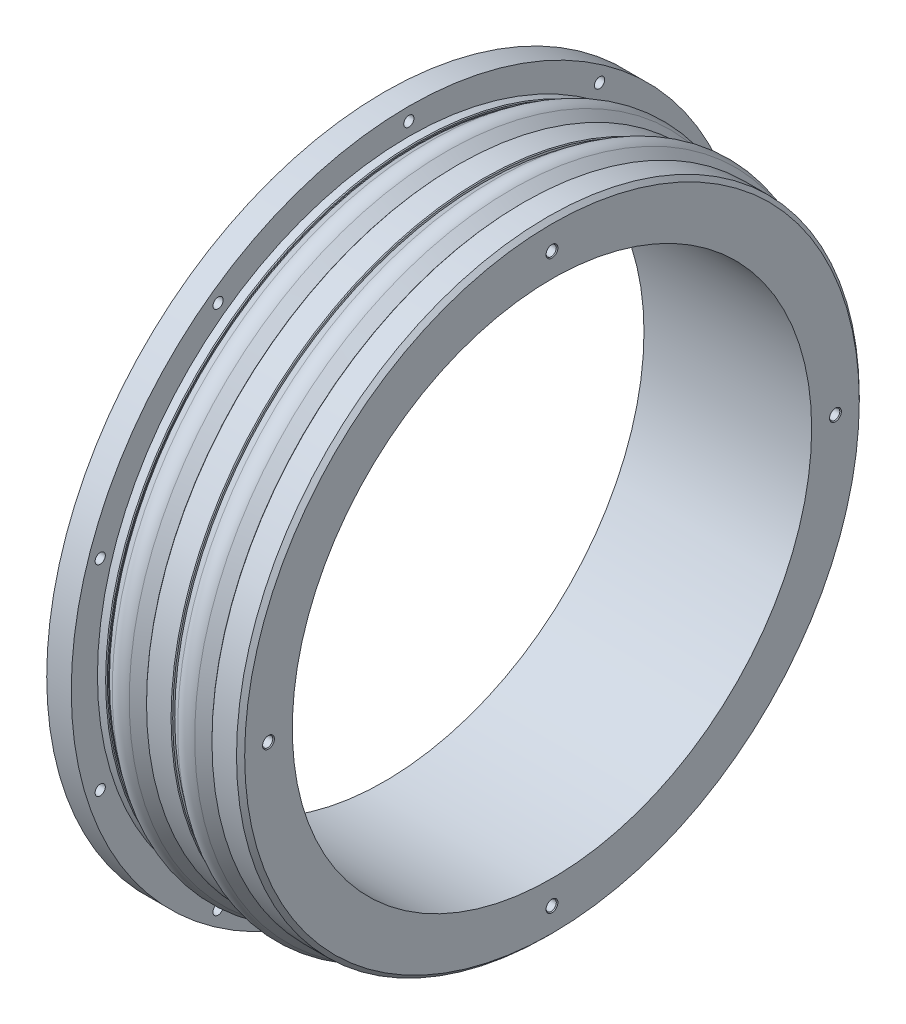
from build123d import *
from OCP.BRepFilletAPI import BRepFilletAPI_MakeChamfer

# Parameters (mm, degrees)
CHAMFER1_SIZE                         = 1
CHAMFER2_SIZE                         = 0.2
CHAMFER2_SIZE2                        = 0.142980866
SKETCH4_W                             = 1.25
SKETCH4_H                             = 6.498
TAP_DRILL_FOR_M3X0_5_TAP1_AT_2_COUNT  = 2
TAP_DRILL_FOR_M3X0_5_TAP1_AT_2_PITCH  = 49.040997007
TAP_DRILL_FOR_M3X0_5_TAP1_AT_3_COUNT  = 2
TAP_DRILL_FOR_M3X0_5_TAP1_AT_3_PITCH  = 93.281519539
TAP_DRILL_FOR_M3X0_5_TAP1_AT_4_COUNT  = 2
TAP_DRILL_FOR_M3X0_5_TAP1_AT_4_PITCH  = 128.390997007
TAP_DRILL_FOR_M3X0_5_TAP1_AT_5_COUNT  = 2
TAP_DRILL_FOR_M3X0_5_TAP1_AT_5_PITCH  = 150.932669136
TAP_DRILL_FOR_M3X0_5_TAP1_AT_6_COUNT  = 2
TAP_DRILL_FOR_M3X0_5_TAP1_AT_6_PITCH  = 158.7
TAP_DRILL_FOR_M3X0_5_TAP1_AT_7_COUNT  = 2
TAP_DRILL_FOR_M3X0_5_TAP1_AT_7_PITCH  = 150.932669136
TAP_DRILL_FOR_M3X0_5_TAP1_AT_8_COUNT  = 2
TAP_DRILL_FOR_M3X0_5_TAP1_AT_8_PITCH  = 128.390997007
TAP_DRILL_FOR_M3X0_5_TAP1_AT_9_COUNT  = 2
TAP_DRILL_FOR_M3X0_5_TAP1_AT_9_PITCH  = 93.281519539
TAP_DRILL_FOR_M3X0_5_TAP1_AT_10_COUNT = 2
TAP_DRILL_FOR_M3X0_5_TAP1_AT_10_PITCH = 49.040997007
CHAMFER3_SIZE                         = 0.2
TAP_DRILL_FOR_M3X0_5_TAP2_D           = 2.5
TAP_DRILL_FOR_M3X0_5_TAP2_DEPTH       = 4
TAP_DRILL_FOR_M3X0_5_TAP2_TIP         = 0.751075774
CHAMFER4_SIZE                         = 0.2


with BuildPart() as part:
    # Sketch2 → Revolve1 (revolve)
    with BuildSketch(Plane(origin=(0, 0, 0), x_dir=(1, 0, 0), z_dir=(0, 1, 0))):
        with BuildLine():
            Line((0, 63.5), (41, 63.5))
            Line((41, 63.5), (41, 76.145))
            Line((41, 76.145), (33.8, 76.145))
            Line((33.8, 76.145), (33.8, 75.445))
            Line((33.8, 75.445), (31.083348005, 77.45741197))
            ThreePointArc((31.083348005, 77.45741197), (29, 78.145), (26.916651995, 77.45741197))
            Line((26.916651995, 77.45741197), (24.2, 75.445))
            Line((24.2, 75.445), (24.2, 76.145))
            Line((24.2, 76.145), (17.8, 76.145))
            Line((17.8, 76.145), (17.8, 75.445))
            Line((17.8, 75.445), (15.083348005, 77.45741197))
            ThreePointArc((15.083348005, 77.45741197), (13, 78.145), (10.916651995, 77.45741197))
            Line((10.916651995, 77.45741197), (8.2, 75.445))
            Line((8.2, 75.445), (8.2, 76.145))
            Line((8.2, 76.145), (6, 76.145))
            Line((6, 76.145), (6, 82.55))
            Line((6, 82.55), (0, 82.55))
            Line((0, 82.55), (0, 75.871))
            Line((0, 75.871), (0.75, 75.871))
            Line((0.75, 75.871), (0.009866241, 75.32584129))
            ThreePointArc((0.009866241, 75.32584129), (-0.498, 74.321), (0.009866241, 73.31615871))
            Line((0.009866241, 73.31615871), (0.75, 72.771))
            Line((0.75, 72.771), (0, 72.771))
            Line((0, 72.771), (0, 63.5))
        make_face()
    revolve(axis=Axis((0, 0, 0), (-1, 0, 0)))

    # Chamfer1
    chamfer1_edges = [part.edges().sort_by_distance(p)[0] for p in [
        (41, 0, 76.145),
    ]]
    chamfer(chamfer1_edges, length=CHAMFER1_SIZE)

    # Chamfer2: one chamfer whose edges measure the first distance from different faces: ONE call of the kernel's chamfer builder (chamfer() names one face for all edges)
    chamfer2_edges_1 = [part.edges().sort_by_distance(p)[0] for p in [
        (0, 0, 75.871),
        (8.2, 0, 76.145),
        (17.8, 0, 76.145),
        (24.2, 0, 76.145),
        (33.8, 0, 76.145),
        (0, 0, 72.771),
    ]]
    chamfer2_edges_2 = [part.edges().sort_by_distance(p)[0] for p in [
        (8.2, 0, 75.445),
    ]]
    chamfer2_side_2 = [part.faces().sort_by_distance(p)[0] for p in [
        (8.2, 0, 75.660370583),
    ]]
    chamfer2 = BRepFilletAPI_MakeChamfer(part.part.solid().wrapped)
    for e in chamfer2_edges_1:
        chamfer2.Add(CHAMFER2_SIZE, e.wrapped)
    for e in chamfer2_edges_2:
        chamfer2.Add(CHAMFER2_SIZE, CHAMFER2_SIZE2, e.wrapped, chamfer2_side_2[0].wrapped)  # the first distance lies on this face
    add(Compound.cast(chamfer2.Shape()), mode=Mode.REPLACE)

    # Sketch4 → Tap Drill for M3x0.5 Tap1 (revolve, cut)
    with BuildSketch(Plane(origin=(6, 79.35, 0), x_dir=(0, 0, -1), z_dir=(0, 1, 0))):
        with Locations((0.625, 3.249)):
            Rectangle(SKETCH4_W, SKETCH4_H)
    tap_drill_for_m3x0_5_tap1 = revolve(axis=Axis((12.35, 79.35, 0), (-1, 0, 0)), mode=Mode.SUBTRACT)

    # Tap Drill for M3x0.5 Tap1 at 2: Tap Drill for M3x0.5 Tap1 ×2
    with Locations(*[Vector(0, -0.30901699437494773, -0.9510565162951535) * (i * TAP_DRILL_FOR_M3X0_5_TAP1_AT_2_PITCH) for i in range(1, TAP_DRILL_FOR_M3X0_5_TAP1_AT_2_COUNT)]):
        add(tap_drill_for_m3x0_5_tap1, mode=Mode.SUBTRACT)

    # Tap Drill for M3x0.5 Tap1 at 3: Tap Drill for M3x0.5 Tap1 ×2
    with Locations(*[Vector(0, -0.5877852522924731, -0.8090169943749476) * (i * TAP_DRILL_FOR_M3X0_5_TAP1_AT_3_PITCH) for i in range(1, TAP_DRILL_FOR_M3X0_5_TAP1_AT_3_COUNT)]):
        add(tap_drill_for_m3x0_5_tap1, mode=Mode.SUBTRACT)

    # Tap Drill for M3x0.5 Tap1 at 4: Tap Drill for M3x0.5 Tap1 ×2
    with Locations(*[Vector(0, -0.8090169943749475, -0.5877852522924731) * (i * TAP_DRILL_FOR_M3X0_5_TAP1_AT_4_PITCH) for i in range(1, TAP_DRILL_FOR_M3X0_5_TAP1_AT_4_COUNT)]):
        add(tap_drill_for_m3x0_5_tap1, mode=Mode.SUBTRACT)

    # Tap Drill for M3x0.5 Tap1 at 5: Tap Drill for M3x0.5 Tap1 ×2
    with Locations(*[Vector(0, -0.9510565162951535, -0.3090169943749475) * (i * TAP_DRILL_FOR_M3X0_5_TAP1_AT_5_PITCH) for i in range(1, TAP_DRILL_FOR_M3X0_5_TAP1_AT_5_COUNT)]):
        add(tap_drill_for_m3x0_5_tap1, mode=Mode.SUBTRACT)

    # Tap Drill for M3x0.5 Tap1 at 6: Tap Drill for M3x0.5 Tap1 ×2
    with Locations(*[(0, -i * TAP_DRILL_FOR_M3X0_5_TAP1_AT_6_PITCH, 0) for i in range(1, TAP_DRILL_FOR_M3X0_5_TAP1_AT_6_COUNT)]):
        add(tap_drill_for_m3x0_5_tap1, mode=Mode.SUBTRACT)

    # Tap Drill for M3x0.5 Tap1 at 7: Tap Drill for M3x0.5 Tap1 ×2
    with Locations(*[Vector(0, -0.9510565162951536, 0.30901699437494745) * (i * TAP_DRILL_FOR_M3X0_5_TAP1_AT_7_PITCH) for i in range(1, TAP_DRILL_FOR_M3X0_5_TAP1_AT_7_COUNT)]):
        add(tap_drill_for_m3x0_5_tap1, mode=Mode.SUBTRACT)

    # Tap Drill for M3x0.5 Tap1 at 8: Tap Drill for M3x0.5 Tap1 ×2
    with Locations(*[Vector(0, -0.8090169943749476, 0.5877852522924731) * (i * TAP_DRILL_FOR_M3X0_5_TAP1_AT_8_PITCH) for i in range(1, TAP_DRILL_FOR_M3X0_5_TAP1_AT_8_COUNT)]):
        add(tap_drill_for_m3x0_5_tap1, mode=Mode.SUBTRACT)

    # Tap Drill for M3x0.5 Tap1 at 9: Tap Drill for M3x0.5 Tap1 ×2
    with Locations(*[Vector(0, -0.5877852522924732, 0.8090169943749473) * (i * TAP_DRILL_FOR_M3X0_5_TAP1_AT_9_PITCH) for i in range(1, TAP_DRILL_FOR_M3X0_5_TAP1_AT_9_COUNT)]):
        add(tap_drill_for_m3x0_5_tap1, mode=Mode.SUBTRACT)

    # Tap Drill for M3x0.5 Tap1 at 10: Tap Drill for M3x0.5 Tap1 ×2
    with Locations(*[Vector(0, -0.30901699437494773, 0.9510565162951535) * (i * TAP_DRILL_FOR_M3X0_5_TAP1_AT_10_PITCH) for i in range(1, TAP_DRILL_FOR_M3X0_5_TAP1_AT_10_COUNT)]):
        add(tap_drill_for_m3x0_5_tap1, mode=Mode.SUBTRACT)

    # Chamfer3
    chamfer3_edges = [part.edges().sort_by_distance(p)[0] for p in [
        (0, 24.520498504, 76.716334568),
        (0, -24.520498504, 76.716334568),
        (0, -64.195498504, 47.890759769),
        (0, -79.35, 1.25),
        (0, -64.195498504, -45.390759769),
        (0, -24.520498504, -74.216334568),
        (0, 24.520498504, -74.216334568),
        (0, 64.195498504, -45.390759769),
        (0, 79.35, 1.25),
        (0, 64.195498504, 47.890759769),
    ]]
    chamfer(chamfer3_edges, length=CHAMFER3_SIZE)

    # Tap Drill for M3x0.5 Tap2
    with Locations(Plane(origin=(41, 69.3225, 0), x_dir=(0, 0, 1), z_dir=(1, 0, 0))):
        with Locations((0, 0), (-69.3225, 69.3225), (0, 138.645), (69.3225, 69.3225)):
            Hole(TAP_DRILL_FOR_M3X0_5_TAP2_D / 2, depth=TAP_DRILL_FOR_M3X0_5_TAP2_DEPTH)
            with Locations((0, 0, -(TAP_DRILL_FOR_M3X0_5_TAP2_DEPTH + TAP_DRILL_FOR_M3X0_5_TAP2_TIP / 2))):  # 118° drill point
                Cone(0, TAP_DRILL_FOR_M3X0_5_TAP2_D / 2, TAP_DRILL_FOR_M3X0_5_TAP2_TIP, mode=Mode.SUBTRACT)

    # Chamfer4
    chamfer4_edges = [part.edges().sort_by_distance(p)[0] for p in [
        (41, 0, 70.5725),
        (41, -69.3225, 1.25),
        (41, 0, -68.0725),
        (41, 69.3225, 1.25),
    ]]
    chamfer(chamfer4_edges, length=CHAMFER4_SIZE)


solid = part.part
